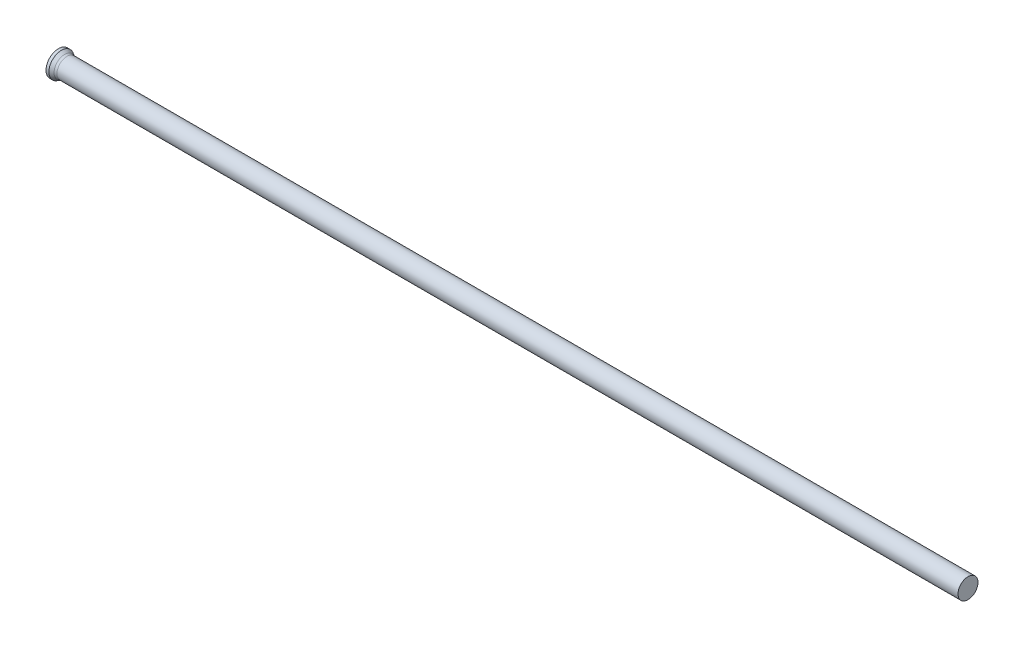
ISO-10303-21;
HEADER;
FILE_DESCRIPTION(('STEP AP214'),'2;1');
FILE_NAME('part.step','',(''),(''),'','','');
FILE_SCHEMA(('AUTOMOTIVE_DESIGN { 1 0 10303 214 1 1 1 1 }'));
ENDSEC;
DATA;
#1=APPLICATION_CONTEXT('core data for automotive mechanical design processes');
#2=APPLICATION_PROTOCOL_DEFINITION('international standard','automotive_design',2000,#1);
#3=PRODUCT_CONTEXT('',#1,'mechanical');
#4=PRODUCT('Part','Part','',(#3));
#5=PRODUCT_RELATED_PRODUCT_CATEGORY('part','',(#4));
#6=PRODUCT_DEFINITION_FORMATION('','',#4);
#7=PRODUCT_DEFINITION_CONTEXT('part definition',#1,'design');
#8=PRODUCT_DEFINITION('design','',#6,#7);
#9=PRODUCT_DEFINITION_SHAPE('','',#8);
#10=(LENGTH_UNIT() NAMED_UNIT(*) SI_UNIT(.MILLI.,.METRE.));
#11=(NAMED_UNIT(*) PLANE_ANGLE_UNIT() SI_UNIT($,.RADIAN.));
#12=(NAMED_UNIT(*) SI_UNIT($,.STERADIAN.) SOLID_ANGLE_UNIT());
#13=UNCERTAINTY_MEASURE_WITH_UNIT(LENGTH_MEASURE(1.E-05),#10,'distance_accuracy_value','');
#14=(GEOMETRIC_REPRESENTATION_CONTEXT(3) GLOBAL_UNCERTAINTY_ASSIGNED_CONTEXT((#13)) GLOBAL_UNIT_ASSIGNED_CONTEXT((#10,
#11,#12)) REPRESENTATION_CONTEXT('',''));
#15=CARTESIAN_POINT('',(0.,0.,0.));
#16=DIRECTION('',(0.,0.,1.));
#17=DIRECTION('',(1.,0.,0.));
#18=AXIS2_PLACEMENT_3D('',#15,#16,#17);
#19=CARTESIAN_POINT('',(0.,0.,0.));
#20=DIRECTION('',(1.,0.,0.));
#21=DIRECTION('',(0.,0.,-1.));
#22=AXIS2_PLACEMENT_3D('',#19,#20,#21);
#23=PLANE('',#22);
#24=CARTESIAN_POINT('',(0.,0.,0.));
#25=DIRECTION('',(-1.,0.,0.));
#26=DIRECTION('',(0.,0.,1.));
#27=AXIS2_PLACEMENT_3D('',#24,#25,#26);
#28=CIRCLE('',#27,2.75);
#29=CARTESIAN_POINT('',(0.,0.,2.75));
#30=VERTEX_POINT('',#29);
#31=EDGE_CURVE('E25',#30,#30,#28,.T.);
#32=ORIENTED_EDGE('',*,*,#31,.T.);
#33=EDGE_LOOP('',(#32));
#34=FACE_BOUND('',#33,.T.);
#35=ADVANCED_FACE('F14',(#34),#23,.F.);
#36=CARTESIAN_POINT('',(0.,0.,0.));
#37=DIRECTION('',(-1.,0.,0.));
#38=DIRECTION('',(0.,0.,1.));
#39=AXIS2_PLACEMENT_3D('',#36,#37,#38);
#40=CYLINDRICAL_SURFACE('',#39,2.75);
#41=ORIENTED_EDGE('',*,*,#31,.F.);
#42=EDGE_LOOP('',(#41));
#43=FACE_BOUND('',#42,.T.);
#44=CARTESIAN_POINT('',(0.637372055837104,0.,0.));
#45=DIRECTION('',(-1.,0.,0.));
#46=DIRECTION('',(0.,0.,1.));
#47=AXIS2_PLACEMENT_3D('',#44,#45,#46);
#48=CIRCLE('',#47,2.75);
#49=CARTESIAN_POINT('',(0.637372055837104,0.,2.75));
#50=VERTEX_POINT('',#49);
#51=EDGE_CURVE('E29',#50,#50,#48,.T.);
#52=ORIENTED_EDGE('',*,*,#51,.T.);
#53=EDGE_LOOP('',(#52));
#54=FACE_BOUND('',#53,.T.);
#55=ADVANCED_FACE('F53',(#43,#54),#40,.T.);
#56=CARTESIAN_POINT('',(1.59,0.,0.));
#57=DIRECTION('',(-1.,0.,0.));
#58=DIRECTION('',(0.,0.,1.));
#59=AXIS2_PLACEMENT_3D('',#56,#57,#58);
#60=CONICAL_SURFACE('',#59,2.2,0.523598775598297);
#61=CARTESIAN_POINT('',(1.35794919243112,0.,0.));
#62=DIRECTION('',(-1.,0.,0.));
#63=DIRECTION('',(0.,0.,1.));
#64=AXIS2_PLACEMENT_3D('',#61,#62,#63);
#65=CIRCLE('',#64,2.33397459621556);
#66=CARTESIAN_POINT('',(1.35794919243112,0.,2.33397459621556));
#67=VERTEX_POINT('',#66);
#68=EDGE_CURVE('E21',#67,#67,#65,.T.);
#69=ORIENTED_EDGE('',*,*,#68,.T.);
#70=EDGE_LOOP('',(#69));
#71=FACE_BOUND('',#70,.T.);
#72=ORIENTED_EDGE('',*,*,#51,.F.);
#73=EDGE_LOOP('',(#72));
#74=FACE_BOUND('',#73,.T.);
#75=ADVANCED_FACE('F50',(#71,#74),#60,.T.);
#76=CARTESIAN_POINT('',(0.,0.,0.));
#77=DIRECTION('',(-1.,0.,0.));
#78=DIRECTION('',(0.,0.,1.));
#79=AXIS2_PLACEMENT_3D('',#76,#77,#78);
#80=CYLINDRICAL_SURFACE('',#79,2.2);
#81=CARTESIAN_POINT('',(1.85794919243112,0.,0.));
#82=DIRECTION('',(-1.,0.,0.));
#83=DIRECTION('',(0.,0.,1.));
#84=AXIS2_PLACEMENT_3D('',#81,#82,#83);
#85=CIRCLE('',#84,2.2);
#86=CARTESIAN_POINT('',(1.85794919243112,0.,2.2));
#87=VERTEX_POINT('',#86);
#88=EDGE_CURVE('E9',#87,#87,#85,.F.);
#89=ORIENTED_EDGE('',*,*,#88,.T.);
#90=EDGE_LOOP('',(#89));
#91=FACE_BOUND('',#90,.T.);
#92=CARTESIAN_POINT('',(200.,0.,0.));
#93=DIRECTION('',(-1.,0.,0.));
#94=DIRECTION('',(0.,0.,1.));
#95=AXIS2_PLACEMENT_3D('',#92,#93,#94);
#96=CIRCLE('',#95,2.2);
#97=CARTESIAN_POINT('',(200.,0.,2.2));
#98=VERTEX_POINT('',#97);
#99=EDGE_CURVE('E34',#98,#98,#96,.T.);
#100=ORIENTED_EDGE('',*,*,#99,.T.);
#101=EDGE_LOOP('',(#100));
#102=FACE_BOUND('',#101,.T.);
#103=ADVANCED_FACE('F38',(#91,#102),#80,.T.);
#104=CARTESIAN_POINT('',(200.,2.2,0.));
#105=DIRECTION('',(-1.,0.,0.));
#106=DIRECTION('',(0.,0.,1.));
#107=AXIS2_PLACEMENT_3D('',#104,#105,#106);
#108=PLANE('',#107);
#109=ORIENTED_EDGE('',*,*,#99,.F.);
#110=EDGE_LOOP('',(#109));
#111=FACE_BOUND('',#110,.T.);
#112=ADVANCED_FACE('F40',(#111),#108,.F.);
#113=CARTESIAN_POINT('',(1.85794919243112,0.,0.));
#114=DIRECTION('',(-1.,0.,0.));
#115=DIRECTION('',(0.,0.,1.));
#116=AXIS2_PLACEMENT_3D('',#113,#114,#115);
#117=TOROIDAL_SURFACE('',#116,3.2,1.);
#118=ORIENTED_EDGE('',*,*,#88,.F.);
#119=EDGE_LOOP('',(#118));
#120=FACE_BOUND('',#119,.T.);
#121=ORIENTED_EDGE('',*,*,#68,.F.);
#122=EDGE_LOOP('',(#121));
#123=FACE_BOUND('',#122,.T.);
#124=ADVANCED_FACE('F16',(#120,#123),#117,.F.);
#125=CLOSED_SHELL('',(#35,#55,#75,#103,#112,#124));
#126=MANIFOLD_SOLID_BREP('B1',#125);
#127=ADVANCED_BREP_SHAPE_REPRESENTATION('',(#18,#126),#14);
#128=SHAPE_DEFINITION_REPRESENTATION(#9,#127);
ENDSEC;
END-ISO-10303-21;
